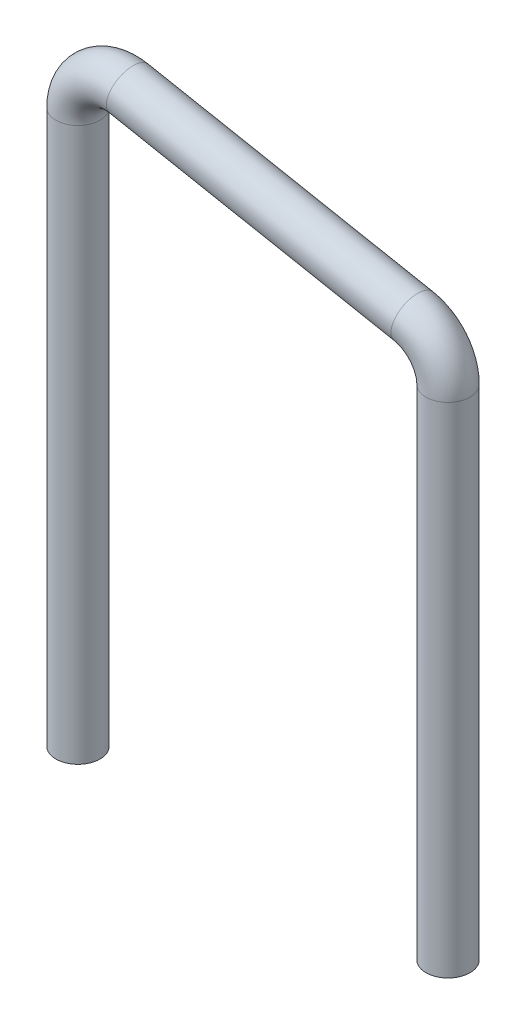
ISO-10303-21;
HEADER;
FILE_DESCRIPTION(('STEP AP214'),'2;1');
FILE_NAME('part.step','',(''),(''),'','','');
FILE_SCHEMA(('AUTOMOTIVE_DESIGN { 1 0 10303 214 1 1 1 1 }'));
ENDSEC;
DATA;
#1=APPLICATION_CONTEXT('core data for automotive mechanical design processes');
#2=APPLICATION_PROTOCOL_DEFINITION('international standard','automotive_design',2000,#1);
#3=PRODUCT_CONTEXT('',#1,'mechanical');
#4=PRODUCT('Part','Part','',(#3));
#5=PRODUCT_RELATED_PRODUCT_CATEGORY('part','',(#4));
#6=PRODUCT_DEFINITION_FORMATION('','',#4);
#7=PRODUCT_DEFINITION_CONTEXT('part definition',#1,'design');
#8=PRODUCT_DEFINITION('design','',#6,#7);
#9=PRODUCT_DEFINITION_SHAPE('','',#8);
#10=(LENGTH_UNIT() NAMED_UNIT(*) SI_UNIT(.MILLI.,.METRE.));
#11=(NAMED_UNIT(*) PLANE_ANGLE_UNIT() SI_UNIT($,.RADIAN.));
#12=(NAMED_UNIT(*) SI_UNIT($,.STERADIAN.) SOLID_ANGLE_UNIT());
#13=UNCERTAINTY_MEASURE_WITH_UNIT(LENGTH_MEASURE(1.E-05),#10,'distance_accuracy_value','');
#14=(GEOMETRIC_REPRESENTATION_CONTEXT(3) GLOBAL_UNCERTAINTY_ASSIGNED_CONTEXT((#13)) GLOBAL_UNIT_ASSIGNED_CONTEXT((#10,
#11,#12)) REPRESENTATION_CONTEXT('',''));
#15=CARTESIAN_POINT('',(0.,0.,0.));
#16=DIRECTION('',(0.,0.,1.));
#17=DIRECTION('',(1.,0.,0.));
#18=AXIS2_PLACEMENT_3D('',#15,#16,#17);
#19=CARTESIAN_POINT('',(-52.,77.7362143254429,0.));
#20=DIRECTION('',(0.,-1.,0.));
#21=DIRECTION('',(1.,0.,0.));
#22=AXIS2_PLACEMENT_3D('',#19,#20,#21);
#23=CYLINDRICAL_SURFACE('',#22,3.1);
#24=CARTESIAN_POINT('',(-52.,77.7362143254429,0.));
#25=DIRECTION('',(0.,-1.,0.));
#26=DIRECTION('',(0.,0.,1.));
#27=AXIS2_PLACEMENT_3D('',#24,#25,#26);
#28=CIRCLE('',#27,3.1);
#29=CARTESIAN_POINT('',(-55.1,77.7362143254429,0.));
#30=VERTEX_POINT('',#29);
#31=EDGE_CURVE('E42',#30,#30,#28,.T.);
#32=ORIENTED_EDGE('',*,*,#31,.T.);
#33=EDGE_LOOP('',(#32));
#34=FACE_BOUND('',#33,.T.);
#35=CARTESIAN_POINT('',(-52.,0.,0.));
#36=DIRECTION('',(0.,-1.,0.));
#37=DIRECTION('',(0.,0.,1.));
#38=AXIS2_PLACEMENT_3D('',#35,#36,#37);
#39=CIRCLE('',#38,3.1);
#40=CARTESIAN_POINT('',(-52.,0.,3.1));
#41=VERTEX_POINT('',#40);
#42=EDGE_CURVE('E12',#41,#41,#39,.T.);
#43=ORIENTED_EDGE('',*,*,#42,.F.);
#44=EDGE_LOOP('',(#43));
#45=FACE_BOUND('',#44,.T.);
#46=ADVANCED_FACE('F36',(#34,#45),#23,.T.);
#47=CARTESIAN_POINT('',(-46.,77.7362143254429,0.));
#48=DIRECTION('',(0.,0.,1.));
#49=DIRECTION('',(1.,0.,0.));
#50=AXIS2_PLACEMENT_3D('',#47,#48,#49);
#51=TOROIDAL_SURFACE('',#50,6.,3.1);
#52=CARTESIAN_POINT('',(-44.8669156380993,83.6282530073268,0.));
#53=DIRECTION('',(-0.982006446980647,0.188847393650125,0.));
#54=DIRECTION('',(0.,0.,1.));
#55=AXIS2_PLACEMENT_3D('',#52,#53,#54);
#56=CIRCLE('',#55,3.1);
#57=CARTESIAN_POINT('',(-44.2814887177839,86.6724729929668,0.));
#58=VERTEX_POINT('',#57);
#59=EDGE_CURVE('E46',#58,#58,#56,.T.);
#60=CARTESIAN_POINT('',(-46.,77.7362143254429,0.));
#61=DIRECTION('',(0.,0.,1.));
#62=DIRECTION('',(1.,0.,0.));
#63=AXIS2_PLACEMENT_3D('',#60,#61,#62);
#64=CIRCLE('',#63,9.1);
#65=EDGE_CURVE('',#58,#30,#64,.T.);
#66=ORIENTED_EDGE('',*,*,#59,.T.);
#67=ORIENTED_EDGE('',*,*,#31,.F.);
#68=ORIENTED_EDGE('',*,*,#65,.T.);
#69=ORIENTED_EDGE('',*,*,#65,.F.);
#70=EDGE_LOOP('',(#66,#68,#67,#69));
#71=FACE_BOUND('',#70,.T.);
#72=ADVANCED_FACE('F73',(#71),#51,.T.);
#73=CARTESIAN_POINT('',(-4.86691563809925,75.9359453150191,0.));
#74=DIRECTION('',(-0.982006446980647,0.188847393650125,0.));
#75=DIRECTION('',(-0.188847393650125,-0.982006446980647,0.));
#76=AXIS2_PLACEMENT_3D('',#73,#74,#75);
#77=CYLINDRICAL_SURFACE('',#76,3.1);
#78=CARTESIAN_POINT('',(-4.86691563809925,75.9359453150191,0.));
#79=DIRECTION('',(-0.982006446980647,0.188847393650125,0.));
#80=DIRECTION('',(0.,0.,1.));
#81=AXIS2_PLACEMENT_3D('',#78,#79,#80);
#82=CIRCLE('',#81,3.1);
#83=CARTESIAN_POINT('',(-4.28148871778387,78.9801653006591,0.));
#84=VERTEX_POINT('',#83);
#85=EDGE_CURVE('E50',#84,#84,#82,.T.);
#86=ORIENTED_EDGE('',*,*,#85,.T.);
#87=EDGE_LOOP('',(#86));
#88=FACE_BOUND('',#87,.T.);
#89=ORIENTED_EDGE('',*,*,#59,.F.);
#90=EDGE_LOOP('',(#89));
#91=FACE_BOUND('',#90,.T.);
#92=ADVANCED_FACE('F77',(#88,#91),#77,.T.);
#93=CARTESIAN_POINT('',(-6.,70.0439066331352,0.));
#94=DIRECTION('',(0.,0.,1.));
#95=DIRECTION('',(1.,0.,0.));
#96=AXIS2_PLACEMENT_3D('',#93,#94,#95);
#97=TOROIDAL_SURFACE('',#96,6.,3.1);
#98=CARTESIAN_POINT('',(0.,70.0439066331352,0.));
#99=DIRECTION('',(0.,1.,0.));
#100=DIRECTION('',(0.,0.,1.));
#101=AXIS2_PLACEMENT_3D('',#98,#99,#100);
#102=CIRCLE('',#101,3.1);
#103=CARTESIAN_POINT('',(3.1,70.0439066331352,0.));
#104=VERTEX_POINT('',#103);
#105=EDGE_CURVE('E55',#104,#104,#102,.T.);
#106=CARTESIAN_POINT('',(-6.,70.0439066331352,0.));
#107=DIRECTION('',(0.,0.,1.));
#108=DIRECTION('',(1.,0.,0.));
#109=AXIS2_PLACEMENT_3D('',#106,#107,#108);
#110=CIRCLE('',#109,9.1);
#111=EDGE_CURVE('',#104,#84,#110,.T.);
#112=ORIENTED_EDGE('',*,*,#105,.T.);
#113=ORIENTED_EDGE('',*,*,#85,.F.);
#114=ORIENTED_EDGE('',*,*,#111,.T.);
#115=ORIENTED_EDGE('',*,*,#111,.F.);
#116=EDGE_LOOP('',(#112,#114,#113,#115));
#117=FACE_BOUND('',#116,.T.);
#118=ADVANCED_FACE('F83',(#117),#97,.T.);
#119=CARTESIAN_POINT('',(0.,70.0439066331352,0.));
#120=DIRECTION('',(0.,-1.,0.));
#121=DIRECTION('',(0.,0.,-1.));
#122=AXIS2_PLACEMENT_3D('',#119,#120,#121);
#123=CYLINDRICAL_SURFACE('',#122,3.1);
#124=ORIENTED_EDGE('',*,*,#105,.F.);
#125=EDGE_LOOP('',(#124));
#126=FACE_BOUND('',#125,.T.);
#127=CARTESIAN_POINT('',(0.,0.,0.));
#128=DIRECTION('',(0.,1.,0.));
#129=DIRECTION('',(0.,0.,1.));
#130=AXIS2_PLACEMENT_3D('',#127,#128,#129);
#131=CIRCLE('',#130,3.1);
#132=CARTESIAN_POINT('',(0.,0.,3.1));
#133=VERTEX_POINT('',#132);
#134=EDGE_CURVE('E58',#133,#133,#131,.T.);
#135=ORIENTED_EDGE('',*,*,#134,.T.);
#136=EDGE_LOOP('',(#135));
#137=FACE_BOUND('',#136,.T.);
#138=ADVANCED_FACE('F62',(#126,#137),#123,.T.);
#139=CARTESIAN_POINT('',(-52.,0.,0.));
#140=DIRECTION('',(0.,-1.,0.));
#141=DIRECTION('',(0.,0.,1.));
#142=AXIS2_PLACEMENT_3D('',#139,#140,#141);
#143=PLANE('',#142);
#144=ORIENTED_EDGE('',*,*,#42,.T.);
#145=EDGE_LOOP('',(#144));
#146=FACE_BOUND('',#145,.T.);
#147=ADVANCED_FACE('F66',(#146),#143,.T.);
#148=CARTESIAN_POINT('',(0.,0.,0.));
#149=DIRECTION('',(0.,1.,0.));
#150=DIRECTION('',(0.,0.,1.));
#151=AXIS2_PLACEMENT_3D('',#148,#149,#150);
#152=PLANE('',#151);
#153=ORIENTED_EDGE('',*,*,#134,.F.);
#154=EDGE_LOOP('',(#153));
#155=FACE_BOUND('',#154,.T.);
#156=ADVANCED_FACE('F64',(#155),#152,.F.);
#157=CLOSED_SHELL('',(#46,#72,#92,#118,#138,#147,#156));
#158=MANIFOLD_SOLID_BREP('B2',#157);
#159=ADVANCED_BREP_SHAPE_REPRESENTATION('',(#18,#158),#14);
#160=SHAPE_DEFINITION_REPRESENTATION(#9,#159);
ENDSEC;
END-ISO-10303-21;
